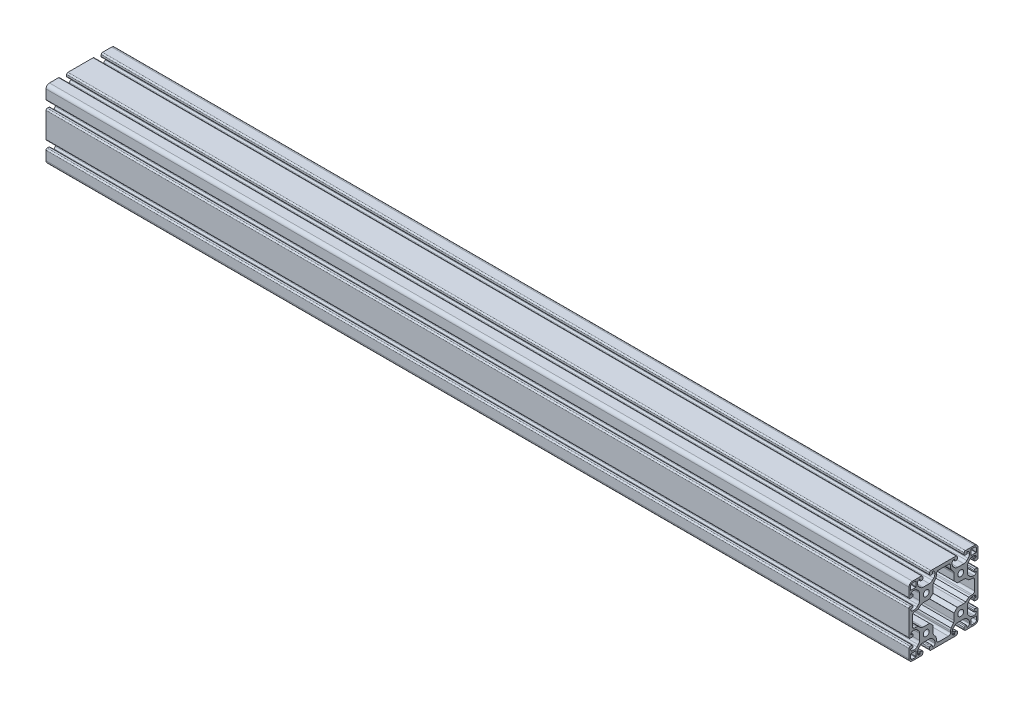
from build123d import *

# Parameters (mm, degrees)
MODEL_R                = 3.4
STRUKTURBAUTEIL1_DEPTH = 1000


with BuildPart() as part:
    # Model → Strukturbauteil1 (new body)
    with BuildSketch(Plane(origin=(0, 0, 0), x_dir=(0, 0, -1), z_dir=(1, 0, 0))):
        with BuildLine():
            Line((-27.5, 38), (-27.146446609, 37.853553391))
            Line((-27.146446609, 37.853553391), (-27, 37.5))
            Line((-27, 37.5), (-27, 36))
            ThreePointArc((-27, 36), (-26.853553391, 35.646446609), (-26.5, 35.5))
            Line((-26.5, 35.5), (-25, 35.5))
            ThreePointArc((-25, 35.5), (-24.292893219, 35.792893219), (-24, 36.5))
            Line((-24, 36.5), (-24, 38.5))
            ThreePointArc((-24, 38.5), (-24.439339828, 39.560660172), (-25.5, 40))
            Line((-25.5, 40), (-36, 40))
            ThreePointArc((-36, 40), (-38.828427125, 38.828427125), (-40, 36))
            Line((-40, 36), (-40, 25.5))
            ThreePointArc((-40, 25.5), (-39.560660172, 24.439339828), (-38.5, 24))
            Line((-38.5, 24), (-36.5, 24))
            ThreePointArc((-36.5, 24), (-35.792893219, 24.292893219), (-35.5, 25))
            Line((-35.5, 25), (-35.5, 26.5))
            ThreePointArc((-35.5, 26.5), (-35.646446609, 26.853553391), (-36, 27))
            Line((-36, 27), (-37.5, 27))
            Line((-37.5, 27), (-37.853553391, 27.146446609))
            Line((-37.853553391, 27.146446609), (-38, 27.5))
            ThreePointArc((-38, 27.5), (-37.267766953, 29.267766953), (-35.5, 30))
            Line((-35.5, 30), (-34.192388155, 30))
            ThreePointArc((-34.192388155, 30), (-32.278970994, 29.619397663), (-30.656854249, 28.535533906))
            Line((-30.656854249, 28.535533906), (-29.214466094, 27.093145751))
            ThreePointArc((-29.214466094, 27.093145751), (-28.130602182, 25.471029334), (-27.749999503, 23.55761243))
            Line((-27.749999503, 23.55761243), (-27.749999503, 16.44238928))
            ThreePointArc((-27.749999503, 16.44238928), (-28.130601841, 14.528972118), (-29.214465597, 12.906855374))
            Line((-29.214465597, 12.906855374), (-30.65685399, 11.464466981))
            ThreePointArc((-30.65685399, 11.464466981), (-32.278970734, 10.380603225), (-34.192387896, 10.000000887))
            Line((-34.192387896, 10.000000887), (-35.499999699, 10.000000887))
            ThreePointArc((-35.499999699, 10.000000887), (-37.267766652, 10.732233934), (-37.999999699, 12.500000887))
            Line((-37.999999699, 12.500000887), (-37.853553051, 12.853554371))
            Line((-37.853553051, 12.853554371), (-37.49999966, 13.000000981))
            Line((-37.49999966, 13.000000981), (-35.999999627, 13.000000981))
            ThreePointArc((-35.999999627, 13.000000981), (-35.646446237, 13.14644759), (-35.499999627, 13.500000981))
            Line((-35.499999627, 13.500000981), (-35.499999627, 15.000000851))
            ThreePointArc((-35.499999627, 15.000000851), (-35.792892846, 15.707107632), (-36.499999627, 16.000000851))
            Line((-36.499999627, 16.000000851), (-38.500000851, 16.000000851))
            ThreePointArc((-38.500000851, 16.000000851), (-39.560666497, 15.560658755), (-40.000008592, 14.499993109))
            Line((-40.000008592, 14.499993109), (-40, -14.5))
            ThreePointArc((-40, -14.5), (-39.560660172, -15.560660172), (-38.5, -16))
            Line((-38.5, -16), (-36.5, -16))
            ThreePointArc((-36.5, -16), (-35.792893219, -15.707106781), (-35.5, -15))
            Line((-35.5, -15), (-35.5, -13.5))
            ThreePointArc((-35.5, -13.5), (-35.646446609, -13.146446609), (-36, -13))
            Line((-36, -13), (-37.5, -13))
            Line((-37.5, -13), (-37.853553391, -12.853553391))
            Line((-37.853553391, -12.853553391), (-38, -12.5))
            ThreePointArc((-38, -12.5), (-37.267766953, -10.732233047), (-35.5, -10))
            Line((-35.5, -10), (-34.192388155, -10))
            ThreePointArc((-34.192388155, -10), (-32.278970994, -10.380602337), (-30.656854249, -11.464466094))
            Line((-30.656854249, -11.464466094), (-29.214466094, -12.906854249))
            ThreePointArc((-29.214466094, -12.906854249), (-28.130602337, -14.528970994), (-27.75, -16.442388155))
            Line((-27.75, -16.442388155), (-27.75, -23.557611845))
            ThreePointArc((-27.75, -23.557611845), (-28.130602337, -25.471029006), (-29.214466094, -27.093145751))
            Line((-29.214466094, -27.093145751), (-30.656854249, -28.535533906))
            ThreePointArc((-30.656854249, -28.535533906), (-32.278970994, -29.619397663), (-34.192388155, -30))
            Line((-34.192388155, -30), (-35.5, -30))
            ThreePointArc((-35.5, -30), (-37.267766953, -29.267766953), (-38, -27.5))
            Line((-38, -27.5), (-37.853553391, -27.146446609))
            Line((-37.853553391, -27.146446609), (-37.5, -27))
            Line((-37.5, -27), (-36, -27))
            ThreePointArc((-36, -27), (-35.646446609, -26.853553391), (-35.5, -26.5))
            Line((-35.5, -26.5), (-35.5, -25))
            ThreePointArc((-35.5, -25), (-35.792893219, -24.292893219), (-36.5, -24))
            Line((-36.5, -24), (-38.5, -24))
            ThreePointArc((-38.5, -24), (-39.560660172, -24.439339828), (-40, -25.5))
            Line((-40, -25.5), (-40, -36))
            ThreePointArc((-40, -36), (-38.828427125, -38.828427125), (-36, -40))
            Line((-36, -40), (-25.5, -40))
            ThreePointArc((-25.5, -40), (-24.439339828, -39.560660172), (-24, -38.5))
            Line((-24, -38.5), (-24, -36.5))
            ThreePointArc((-24, -36.5), (-24.292893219, -35.792893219), (-25, -35.5))
            Line((-25, -35.5), (-26.5, -35.5))
            ThreePointArc((-26.5, -35.5), (-26.853553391, -35.646446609), (-27, -36))
            Line((-27, -36), (-27, -37.5))
            Line((-27, -37.5), (-27.146446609, -37.853553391))
            Line((-27.146446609, -37.853553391), (-27.5, -38))
            ThreePointArc((-27.5, -38), (-29.267766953, -37.267766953), (-30, -35.5))
            Line((-30, -35.5), (-30, -34.192388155))
            ThreePointArc((-30, -34.192388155), (-29.619397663, -32.278970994), (-28.535533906, -30.656854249))
            Line((-28.535533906, -30.656854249), (-27.093145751, -29.214466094))
            ThreePointArc((-27.093145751, -29.214466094), (-25.471029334, -28.130602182), (-23.55761243, -27.749999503))
            Line((-23.55761243, -27.749999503), (-16.44238928, -27.749999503))
            ThreePointArc((-16.44238928, -27.749999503), (-14.528972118, -28.130601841), (-12.906855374, -29.214465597))
            Line((-12.906855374, -29.214465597), (-11.464466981, -30.65685399))
            ThreePointArc((-11.464466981, -30.65685399), (-10.380603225, -32.278970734), (-10.000000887, -34.192387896))
            Line((-10.000000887, -34.192387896), (-10.000000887, -35.499999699))
            ThreePointArc((-10.000000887, -35.499999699), (-10.732233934, -37.267766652), (-12.500000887, -37.999999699))
            Line((-12.500000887, -37.999999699), (-12.853554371, -37.853553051))
            Line((-12.853554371, -37.853553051), (-13.000000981, -37.49999966))
            Line((-13.000000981, -37.49999966), (-13.000000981, -35.999999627))
            ThreePointArc((-13.000000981, -35.999999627), (-13.14644759, -35.646446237), (-13.500000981, -35.499999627))
            Line((-13.500000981, -35.499999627), (-15.000000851, -35.499999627))
            ThreePointArc((-15.000000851, -35.499999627), (-15.707107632, -35.792892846), (-16.000000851, -36.499999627))
            Line((-16.000000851, -36.499999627), (-16.000000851, -38.500000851))
            ThreePointArc((-16.000000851, -38.500000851), (-15.560658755, -39.560666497), (-14.499993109, -40.000008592))
            Line((-14.499993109, -40.000008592), (14.5, -40))
            ThreePointArc((14.5, -40), (15.560660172, -39.560660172), (16, -38.5))
            Line((16, -38.5), (16, -36.5))
            ThreePointArc((16, -36.5), (15.707106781, -35.792893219), (15, -35.5))
            Line((15, -35.5), (13.5, -35.5))
            ThreePointArc((13.5, -35.5), (13.146446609, -35.646446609), (13, -36))
            Line((13, -36), (13, -37.5))
            Line((13, -37.5), (12.853553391, -37.853553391))
            Line((12.853553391, -37.853553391), (12.5, -38))
            ThreePointArc((12.5, -38), (10.732233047, -37.267766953), (10, -35.5))
            Line((10, -35.5), (10, -34.192388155))
            ThreePointArc((10, -34.192388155), (10.380602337, -32.278970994), (11.464466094, -30.656854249))
            Line((11.464466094, -30.656854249), (12.906854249, -29.214466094))
            ThreePointArc((12.906854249, -29.214466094), (14.528970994, -28.130602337), (16.442388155, -27.75))
            Line((16.442388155, -27.75), (23.557611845, -27.75))
            ThreePointArc((23.557611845, -27.75), (25.471029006, -28.130602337), (27.093145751, -29.214466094))
            Line((27.093145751, -29.214466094), (28.535533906, -30.656854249))
            ThreePointArc((28.535533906, -30.656854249), (29.619397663, -32.278970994), (30, -34.192388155))
            Line((30, -34.192388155), (30, -35.5))
            ThreePointArc((30, -35.5), (29.267766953, -37.267766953), (27.5, -38))
            Line((27.5, -38), (27.146446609, -37.853553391))
            Line((27.146446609, -37.853553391), (27, -37.5))
            Line((27, -37.5), (27, -36))
            ThreePointArc((27, -36), (26.853553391, -35.646446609), (26.5, -35.5))
            Line((26.5, -35.5), (25, -35.5))
            ThreePointArc((25, -35.5), (24.292893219, -35.792893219), (24, -36.5))
            Line((24, -36.5), (24, -38.5))
            ThreePointArc((24, -38.5), (24.439339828, -39.560660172), (25.5, -40))
            Line((25.5, -40), (36, -40))
            ThreePointArc((36, -40), (38.828427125, -38.828427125), (40, -36))
            Line((40, -36), (40, -25.5))
            ThreePointArc((40, -25.5), (39.560660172, -24.439339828), (38.5, -24))
            Line((38.5, -24), (36.5, -24))
            ThreePointArc((36.5, -24), (35.792893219, -24.292893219), (35.5, -25))
            Line((35.5, -25), (35.5, -26.5))
            ThreePointArc((35.5, -26.5), (35.646446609, -26.853553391), (36, -27))
            Line((36, -27), (37.5, -27))
            Line((37.5, -27), (37.853553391, -27.146446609))
            Line((37.853553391, -27.146446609), (38, -27.5))
            ThreePointArc((38, -27.5), (37.267766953, -29.267766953), (35.5, -30))
            Line((35.5, -30), (34.192388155, -30))
            ThreePointArc((34.192388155, -30), (32.278970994, -29.619397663), (30.656854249, -28.535533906))
            Line((30.656854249, -28.535533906), (29.214466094, -27.093145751))
            ThreePointArc((29.214466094, -27.093145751), (28.130602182, -25.471029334), (27.749999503, -23.55761243))
            Line((27.749999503, -23.55761243), (27.749999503, -16.44238928))
            ThreePointArc((27.749999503, -16.44238928), (28.130601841, -14.528972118), (29.214465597, -12.906855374))
            Line((29.214465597, -12.906855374), (30.65685399, -11.464466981))
            ThreePointArc((30.65685399, -11.464466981), (32.278970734, -10.380603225), (34.192387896, -10.000000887))
            Line((34.192387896, -10.000000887), (35.499999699, -10.000000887))
            ThreePointArc((35.499999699, -10.000000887), (37.267766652, -10.732233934), (37.999999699, -12.500000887))
            Line((37.999999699, -12.500000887), (37.853553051, -12.853554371))
            Line((37.853553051, -12.853554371), (37.49999966, -13.000000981))
            Line((37.49999966, -13.000000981), (35.999999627, -13.000000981))
            ThreePointArc((35.999999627, -13.000000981), (35.646446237, -13.14644759), (35.499999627, -13.500000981))
            Line((35.499999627, -13.500000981), (35.499999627, -15.000000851))
            ThreePointArc((35.499999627, -15.000000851), (35.792892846, -15.707107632), (36.499999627, -16.000000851))
            Line((36.499999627, -16.000000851), (38.500000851, -16.000000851))
            ThreePointArc((38.500000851, -16.000000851), (39.560666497, -15.560658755), (40.000008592, -14.499993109))
            Line((40.000008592, -14.499993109), (40, 14.5))
            ThreePointArc((40, 14.5), (39.560660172, 15.560660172), (38.5, 16))
            Line((38.5, 16), (36.5, 16))
            ThreePointArc((36.5, 16), (35.792893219, 15.707106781), (35.5, 15))
            Line((35.5, 15), (35.5, 13.5))
            ThreePointArc((35.5, 13.5), (35.646446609, 13.146446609), (36, 13))
            Line((36, 13), (37.5, 13))
            Line((37.5, 13), (37.853553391, 12.853553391))
            Line((37.853553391, 12.853553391), (38, 12.5))
            ThreePointArc((38, 12.5), (37.267766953, 10.732233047), (35.5, 10))
            Line((35.5, 10), (34.192388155, 10))
            ThreePointArc((34.192388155, 10), (32.278970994, 10.380602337), (30.656854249, 11.464466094))
            Line((30.656854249, 11.464466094), (29.214466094, 12.906854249))
            ThreePointArc((29.214466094, 12.906854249), (28.130602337, 14.528970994), (27.75, 16.442388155))
            Line((27.75, 16.442388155), (27.75, 23.557611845))
            ThreePointArc((27.75, 23.557611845), (28.130602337, 25.471029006), (29.214466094, 27.093145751))
            Line((29.214466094, 27.093145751), (30.656854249, 28.535533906))
            ThreePointArc((30.656854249, 28.535533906), (32.278970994, 29.619397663), (34.192388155, 30))
            Line((34.192388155, 30), (35.5, 30))
            ThreePointArc((35.5, 30), (37.267766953, 29.267766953), (38, 27.5))
            Line((38, 27.5), (37.853553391, 27.146446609))
            Line((37.853553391, 27.146446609), (37.5, 27))
            Line((37.5, 27), (36, 27))
            ThreePointArc((36, 27), (35.646446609, 26.853553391), (35.5, 26.5))
            Line((35.5, 26.5), (35.5, 25))
            ThreePointArc((35.5, 25), (35.792893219, 24.292893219), (36.5, 24))
            Line((36.5, 24), (38.5, 24))
            ThreePointArc((38.5, 24), (39.560660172, 24.439339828), (40, 25.5))
            Line((40, 25.5), (40, 36))
            ThreePointArc((40, 36), (38.828427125, 38.828427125), (36, 40))
            Line((36, 40), (25.5, 40))
            ThreePointArc((25.5, 40), (24.439339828, 39.560660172), (24, 38.5))
            Line((24, 38.5), (24, 36.5))
            ThreePointArc((24, 36.5), (24.292893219, 35.792893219), (25, 35.5))
            Line((25, 35.5), (26.5, 35.5))
            ThreePointArc((26.5, 35.5), (26.853553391, 35.646446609), (27, 36))
            Line((27, 36), (27, 37.5))
            Line((27, 37.5), (27.146446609, 37.853553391))
            Line((27.146446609, 37.853553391), (27.5, 38))
            ThreePointArc((27.5, 38), (29.267766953, 37.267766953), (30, 35.5))
            Line((30, 35.5), (30, 34.192388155))
            ThreePointArc((30, 34.192388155), (29.619397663, 32.278970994), (28.535533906, 30.656854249))
            Line((28.535533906, 30.656854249), (27.093145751, 29.214466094))
            ThreePointArc((27.093145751, 29.214466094), (25.471029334, 28.130602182), (23.55761243, 27.749999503))
            Line((23.55761243, 27.749999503), (16.44238928, 27.749999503))
            ThreePointArc((16.44238928, 27.749999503), (14.528972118, 28.130601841), (12.906855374, 29.214465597))
            Line((12.906855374, 29.214465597), (11.464466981, 30.65685399))
            ThreePointArc((11.464466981, 30.65685399), (10.380603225, 32.278970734), (10.000000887, 34.192387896))
            Line((10.000000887, 34.192387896), (10.000000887, 35.499999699))
            ThreePointArc((10.000000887, 35.499999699), (10.732233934, 37.267766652), (12.500000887, 37.999999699))
            Line((12.500000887, 37.999999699), (12.853554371, 37.853553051))
            Line((12.853554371, 37.853553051), (13.000000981, 37.49999966))
            Line((13.000000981, 37.49999966), (13.000000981, 35.999999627))
            ThreePointArc((13.000000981, 35.999999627), (13.14644759, 35.646446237), (13.500000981, 35.499999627))
            Line((13.500000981, 35.499999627), (15.000000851, 35.499999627))
            ThreePointArc((15.000000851, 35.499999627), (15.707107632, 35.792892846), (16.000000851, 36.499999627))
            Line((16.000000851, 36.499999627), (16.000000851, 38.500000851))
            ThreePointArc((16.000000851, 38.500000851), (15.560658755, 39.560666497), (14.499993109, 40.000008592))
            Line((14.499993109, 40.000008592), (-14.5, 40))
            ThreePointArc((-14.5, 40), (-15.560660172, 39.560660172), (-16, 38.5))
            Line((-16, 38.5), (-16, 36.5))
            ThreePointArc((-16, 36.5), (-15.707106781, 35.792893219), (-15, 35.5))
            Line((-15, 35.5), (-13.5, 35.5))
            ThreePointArc((-13.5, 35.5), (-13.146446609, 35.646446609), (-13, 36))
            Line((-13, 36), (-13, 37.5))
            Line((-13, 37.5), (-12.853553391, 37.853553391))
            Line((-12.853553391, 37.853553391), (-12.5, 38))
            ThreePointArc((-12.5, 38), (-10.732233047, 37.267766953), (-10, 35.5))
            Line((-10, 35.5), (-10, 34.192388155))
            ThreePointArc((-10, 34.192388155), (-10.380602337, 32.278970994), (-11.464466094, 30.656854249))
            Line((-11.464466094, 30.656854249), (-12.906854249, 29.214466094))
            ThreePointArc((-12.906854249, 29.214466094), (-14.528970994, 28.130602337), (-16.442388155, 27.75))
            Line((-16.442388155, 27.75), (-23.557611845, 27.75))
            ThreePointArc((-23.557611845, 27.75), (-25.471029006, 28.130602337), (-27.093145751, 29.214466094))
            Line((-27.093145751, 29.214466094), (-28.535533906, 30.656854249))
            ThreePointArc((-28.535533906, 30.656854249), (-29.619397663, 32.278970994), (-30, 34.192388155))
            Line((-30, 34.192388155), (-30, 35.5))
            ThreePointArc((-30, 35.5), (-29.267766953, 37.267766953), (-27.5, 38))
        make_face()
        with Locations((20, 20)):
            Circle(MODEL_R, mode=Mode.SUBTRACT)
        with Locations((-20, 20)):
            Circle(MODEL_R, mode=Mode.SUBTRACT)
        with Locations((20, -20)):
            Circle(MODEL_R, mode=Mode.SUBTRACT)
        with Locations((-20, -20)):
            Circle(MODEL_R, mode=Mode.SUBTRACT)
        with BuildLine():
            Line((-10.225, 27.576240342), (-11.715142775, 25.807611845))
            Line((-11.715142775, 25.807611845), (-12.25, 23.557611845))
            Line((-12.25, 23.557611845), (-12.25, 16.11711396))
            ThreePointArc((-12.25, 16.11711396), (-12.265224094, 16.040577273), (-12.308578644, 15.975692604))
            Line((-12.308578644, 15.975692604), (-15.975692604, 12.308578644))
            ThreePointArc((-15.975692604, 12.308578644), (-16.040577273, 12.265224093), (-16.11711396, 12.25))
            Line((-16.11711396, 12.25), (-23.557611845, 12.25))
            Line((-23.557611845, 12.25), (-25.807611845, 11.715142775))
            Line((-25.807611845, 11.715142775), (-27.576240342, 10.225))
            Line((-27.576240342, 10.225), (-29.344868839, 8.734857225))
            Line((-29.344868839, 8.734857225), (-31.594868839, 8.2))
            Line((-31.594868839, 8.2), (-33.5, 8.2))
            ThreePointArc((-33.5, 8.2), (-35.267766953, 7.467766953), (-36, 5.7))
            Line((-36, 5.7), (-36, 0))
            Line((-36, 0), (-36, -5.7))
            ThreePointArc((-36, -5.7), (-35.267766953, -7.467766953), (-33.5, -8.2))
            Line((-33.5, -8.2), (-31.594868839, -8.2))
            Line((-31.594868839, -8.2), (-29.344868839, -8.734857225))
            Line((-29.344868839, -8.734857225), (-27.576240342, -10.225))
            Line((-27.576240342, -10.225), (-25.807611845, -11.715142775))
            Line((-25.807611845, -11.715142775), (-23.557611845, -12.25))
            Line((-23.557611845, -12.25), (-16.11711396, -12.25))
            ThreePointArc((-16.11711396, -12.25), (-16.040577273, -12.265224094), (-15.975692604, -12.308578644))
            Line((-15.975692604, -12.308578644), (-12.308578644, -15.975692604))
            ThreePointArc((-12.308578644, -15.975692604), (-12.265224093, -16.040577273), (-12.25, -16.11711396))
            Line((-12.25, -16.11711396), (-12.25, -23.557611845))
            Line((-12.25, -23.557611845), (-11.715142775, -25.807611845))
            Line((-11.715142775, -25.807611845), (-10.225, -27.576240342))
            Line((-10.225, -27.576240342), (-8.734857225, -29.344868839))
            Line((-8.734857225, -29.344868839), (-8.2, -31.594868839))
            Line((-8.2, -31.594868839), (-8.2, -33.5))
            ThreePointArc((-8.2, -33.5), (-7.467766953, -35.267766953), (-5.7, -36))
            Line((-5.7, -36), (0, -36))
            Line((0, -36), (5.7, -36))
            ThreePointArc((5.7, -36), (7.467766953, -35.267766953), (8.2, -33.5))
            Line((8.2, -33.5), (8.2, -31.594868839))
            Line((8.2, -31.594868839), (8.734857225, -29.344868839))
            Line((8.734857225, -29.344868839), (10.225, -27.576240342))
            Line((10.225, -27.576240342), (11.715142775, -25.807611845))
            Line((11.715142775, -25.807611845), (12.25, -23.557611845))
            Line((12.25, -23.557611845), (12.25, -16.11711396))
            ThreePointArc((12.25, -16.11711396), (12.265224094, -16.040577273), (12.308578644, -15.975692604))
            Line((12.308578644, -15.975692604), (15.975692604, -12.308578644))
            ThreePointArc((15.975692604, -12.308578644), (16.040577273, -12.265224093), (16.11711396, -12.25))
            Line((16.11711396, -12.25), (23.557611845, -12.25))
            Line((23.557611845, -12.25), (25.807611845, -11.715142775))
            Line((25.807611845, -11.715142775), (27.576240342, -10.225))
            Line((27.576240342, -10.225), (29.344868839, -8.734857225))
            Line((29.344868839, -8.734857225), (31.594868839, -8.2))
            Line((31.594868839, -8.2), (33.5, -8.2))
            ThreePointArc((33.5, -8.2), (35.267766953, -7.467766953), (36, -5.7))
            Line((36, -5.7), (36, 0))
            Line((36, 0), (36, 5.7))
            ThreePointArc((36, 5.7), (35.267766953, 7.467766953), (33.5, 8.2))
            Line((33.5, 8.2), (31.594868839, 8.2))
            Line((31.594868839, 8.2), (29.344868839, 8.734857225))
            Line((29.344868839, 8.734857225), (27.576240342, 10.225))
            Line((27.576240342, 10.225), (25.807611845, 11.715142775))
            Line((25.807611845, 11.715142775), (23.557611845, 12.25))
            Line((23.557611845, 12.25), (16.11711396, 12.25))
            ThreePointArc((16.11711396, 12.25), (16.040577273, 12.265224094), (15.975692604, 12.308578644))
            Line((15.975692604, 12.308578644), (12.308578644, 15.975692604))
            ThreePointArc((12.308578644, 15.975692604), (12.265224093, 16.040577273), (12.25, 16.11711396))
            Line((12.25, 16.11711396), (12.25, 23.557611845))
            Line((12.25, 23.557611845), (11.715142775, 25.807611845))
            Line((11.715142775, 25.807611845), (10.225, 27.576240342))
            Line((10.225, 27.576240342), (8.734857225, 29.344868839))
            Line((8.734857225, 29.344868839), (8.2, 31.594868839))
            Line((8.2, 31.594868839), (8.2, 33.5))
            ThreePointArc((8.2, 33.5), (7.467766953, 35.267766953), (5.7, 36))
            Line((5.7, 36), (0, 36))
            Line((0, 36), (-5.7, 36))
            ThreePointArc((-5.7, 36), (-7.467766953, 35.267766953), (-8.2, 33.5))
            Line((-8.2, 33.5), (-8.2, 31.594868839))
            Line((-8.2, 31.594868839), (-8.734857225, 29.344868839))
            Line((-8.734857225, 29.344868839), (-10.225, 27.576240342))
        make_face(mode=Mode.SUBTRACT)
        with BuildLine():
            Line((-38.2, 36), (-38.2, 32.3))
            ThreePointArc((-38.2, 32.3), (-38.053553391, 31.946446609), (-37.7, 31.8))
            Line((-37.7, 31.8), (-32.3, 31.8))
            ThreePointArc((-32.3, 31.8), (-31.946446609, 31.946446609), (-31.8, 32.3))
            Line((-31.8, 32.3), (-31.8, 37.7))
            ThreePointArc((-31.8, 37.7), (-31.946446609, 38.053553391), (-32.3, 38.2))
            Line((-32.3, 38.2), (-36, 38.2))
            ThreePointArc((-36, 38.2), (-37.555634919, 37.555634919), (-38.2, 36))
        make_face(mode=Mode.SUBTRACT)
        with BuildLine():
            Line((36, 38.2), (32.3, 38.2))
            ThreePointArc((32.3, 38.2), (31.946446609, 38.053553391), (31.8, 37.7))
            Line((31.8, 37.7), (31.8, 32.3))
            ThreePointArc((31.8, 32.3), (31.946446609, 31.946446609), (32.3, 31.8))
            Line((32.3, 31.8), (37.7, 31.8))
            ThreePointArc((37.7, 31.8), (38.053553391, 31.946446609), (38.2, 32.3))
            Line((38.2, 32.3), (38.2, 36))
            ThreePointArc((38.2, 36), (37.555634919, 37.555634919), (36, 38.2))
        make_face(mode=Mode.SUBTRACT)
        with BuildLine():
            Line((38.2, -36), (38.2, -32.3))
            ThreePointArc((38.2, -32.3), (38.053553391, -31.946446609), (37.7, -31.8))
            Line((37.7, -31.8), (32.3, -31.8))
            ThreePointArc((32.3, -31.8), (31.946446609, -31.946446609), (31.8, -32.3))
            Line((31.8, -32.3), (31.8, -37.7))
            ThreePointArc((31.8, -37.7), (31.946446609, -38.053553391), (32.3, -38.2))
            Line((32.3, -38.2), (36, -38.2))
            ThreePointArc((36, -38.2), (37.555634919, -37.555634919), (38.2, -36))
        make_face(mode=Mode.SUBTRACT)
        with BuildLine():
            Line((-36, -38.2), (-32.3, -38.2))
            ThreePointArc((-32.3, -38.2), (-31.946446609, -38.053553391), (-31.8, -37.7))
            Line((-31.8, -37.7), (-31.8, -32.3))
            ThreePointArc((-31.8, -32.3), (-31.946446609, -31.946446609), (-32.3, -31.8))
            Line((-32.3, -31.8), (-37.7, -31.8))
            ThreePointArc((-37.7, -31.8), (-38.053553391, -31.946446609), (-38.2, -32.3))
            Line((-38.2, -32.3), (-38.2, -36))
            ThreePointArc((-38.2, -36), (-37.555634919, -37.555634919), (-36, -38.2))
        make_face(mode=Mode.SUBTRACT)
    extrude(amount=STRUKTURBAUTEIL1_DEPTH)


solid = part.part
